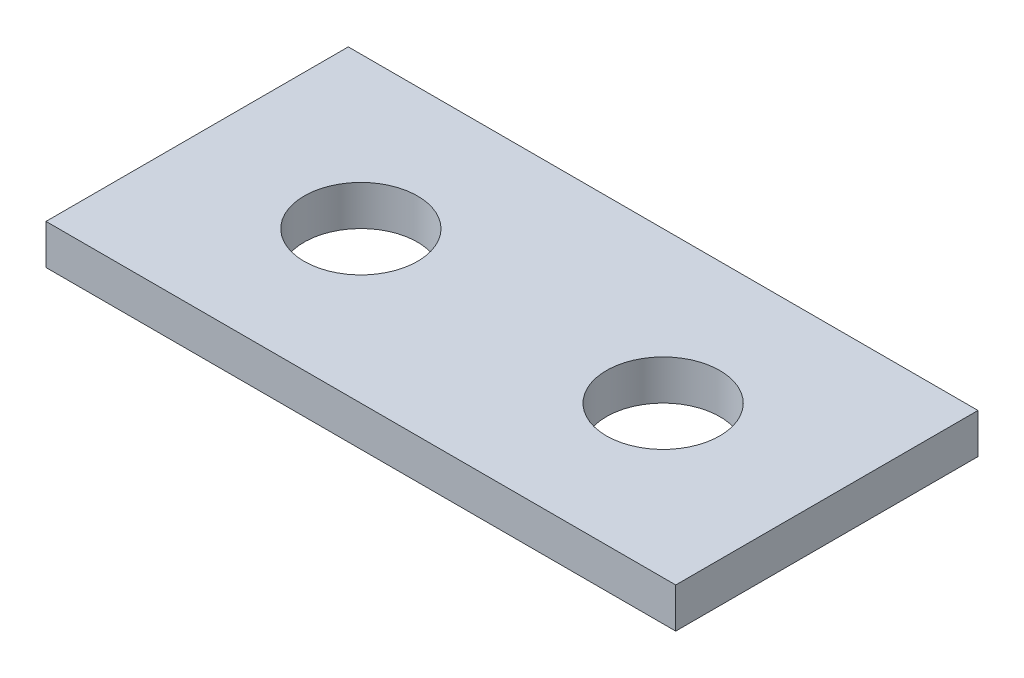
ISO-10303-21;
HEADER;
FILE_DESCRIPTION(('STEP AP214'),'2;1');
FILE_NAME('part.step','',(''),(''),'','','');
FILE_SCHEMA(('AUTOMOTIVE_DESIGN { 1 0 10303 214 1 1 1 1 }'));
ENDSEC;
DATA;
#1=APPLICATION_CONTEXT('core data for automotive mechanical design processes');
#2=APPLICATION_PROTOCOL_DEFINITION('international standard','automotive_design',2000,#1);
#3=PRODUCT_CONTEXT('',#1,'mechanical');
#4=PRODUCT('Part','Part','',(#3));
#5=PRODUCT_RELATED_PRODUCT_CATEGORY('part','',(#4));
#6=PRODUCT_DEFINITION_FORMATION('','',#4);
#7=PRODUCT_DEFINITION_CONTEXT('part definition',#1,'design');
#8=PRODUCT_DEFINITION('design','',#6,#7);
#9=PRODUCT_DEFINITION_SHAPE('','',#8);
#10=(LENGTH_UNIT() NAMED_UNIT(*) SI_UNIT(.MILLI.,.METRE.));
#11=(NAMED_UNIT(*) PLANE_ANGLE_UNIT() SI_UNIT($,.RADIAN.));
#12=(NAMED_UNIT(*) SI_UNIT($,.STERADIAN.) SOLID_ANGLE_UNIT());
#13=UNCERTAINTY_MEASURE_WITH_UNIT(LENGTH_MEASURE(1.E-05),#10,'distance_accuracy_value','');
#14=(GEOMETRIC_REPRESENTATION_CONTEXT(3) GLOBAL_UNCERTAINTY_ASSIGNED_CONTEXT((#13)) GLOBAL_UNIT_ASSIGNED_CONTEXT((#10,
#11,#12)) REPRESENTATION_CONTEXT('',''));
#15=CARTESIAN_POINT('',(0.,0.,0.));
#16=DIRECTION('',(0.,0.,1.));
#17=DIRECTION('',(1.,0.,0.));
#18=AXIS2_PLACEMENT_3D('',#15,#16,#17);
#19=CARTESIAN_POINT('',(25.,3.175,-12.));
#20=DIRECTION('',(-1.,0.,0.));
#21=DIRECTION('',(0.,0.,1.));
#22=AXIS2_PLACEMENT_3D('',#19,#20,#21);
#23=PLANE('',#22);
#24=DIRECTION('',(0.,0.,-1.));
#25=VECTOR('',#24,1.);
#26=CARTESIAN_POINT('',(25.,0.,-12.));
#27=LINE('',#26,#25);
#28=CARTESIAN_POINT('',(25.,0.,12.));
#29=VERTEX_POINT('',#28);
#30=CARTESIAN_POINT('',(25.,0.,-12.));
#31=VERTEX_POINT('',#30);
#32=EDGE_CURVE('E93',#29,#31,#27,.T.);
#33=ORIENTED_EDGE('',*,*,#32,.T.);
#34=DIRECTION('',(0.,-1.,0.));
#35=VECTOR('',#34,1.);
#36=CARTESIAN_POINT('',(25.,3.175,-12.));
#37=LINE('',#36,#35);
#38=CARTESIAN_POINT('',(25.,3.175,-12.));
#39=VERTEX_POINT('',#38);
#40=EDGE_CURVE('E11',#39,#31,#37,.T.);
#41=ORIENTED_EDGE('',*,*,#40,.F.);
#42=DIRECTION('',(0.,0.,-1.));
#43=VECTOR('',#42,1.);
#44=CARTESIAN_POINT('',(25.,3.175,-12.));
#45=LINE('',#44,#43);
#46=CARTESIAN_POINT('',(25.,3.175,12.));
#47=VERTEX_POINT('',#46);
#48=EDGE_CURVE('E81',#47,#39,#45,.T.);
#49=ORIENTED_EDGE('',*,*,#48,.F.);
#50=DIRECTION('',(0.,-1.,0.));
#51=VECTOR('',#50,1.);
#52=CARTESIAN_POINT('',(25.,3.175,12.));
#53=LINE('',#52,#51);
#54=EDGE_CURVE('E89',#47,#29,#53,.T.);
#55=ORIENTED_EDGE('',*,*,#54,.T.);
#56=EDGE_LOOP('',(#33,#41,#49,#55));
#57=FACE_BOUND('',#56,.T.);
#58=ADVANCED_FACE('F30',(#57),#23,.F.);
#59=CARTESIAN_POINT('',(-25.,3.175,-12.));
#60=DIRECTION('',(0.,0.,1.));
#61=DIRECTION('',(1.,0.,0.));
#62=AXIS2_PLACEMENT_3D('',#59,#60,#61);
#63=PLANE('',#62);
#64=DIRECTION('',(-1.,0.,0.));
#65=VECTOR('',#64,1.);
#66=CARTESIAN_POINT('',(-25.,0.,-12.));
#67=LINE('',#66,#65);
#68=CARTESIAN_POINT('',(-25.,0.,-12.));
#69=VERTEX_POINT('',#68);
#70=EDGE_CURVE('E85',#31,#69,#67,.T.);
#71=ORIENTED_EDGE('',*,*,#70,.T.);
#72=DIRECTION('',(0.,-1.,0.));
#73=VECTOR('',#72,1.);
#74=CARTESIAN_POINT('',(-25.,3.175,-12.));
#75=LINE('',#74,#73);
#76=CARTESIAN_POINT('',(-25.,3.175,-12.));
#77=VERTEX_POINT('',#76);
#78=EDGE_CURVE('E38',#77,#69,#75,.T.);
#79=ORIENTED_EDGE('',*,*,#78,.F.);
#80=DIRECTION('',(-1.,0.,0.));
#81=VECTOR('',#80,1.);
#82=CARTESIAN_POINT('',(-25.,3.175,-12.));
#83=LINE('',#82,#81);
#84=EDGE_CURVE('E76',#39,#77,#83,.T.);
#85=ORIENTED_EDGE('',*,*,#84,.F.);
#86=ORIENTED_EDGE('',*,*,#40,.T.);
#87=EDGE_LOOP('',(#71,#79,#85,#86));
#88=FACE_BOUND('',#87,.T.);
#89=ADVANCED_FACE('F84',(#88),#63,.F.);
#90=CARTESIAN_POINT('',(-25.,3.175,-12.));
#91=DIRECTION('',(1.,0.,0.));
#92=DIRECTION('',(0.,0.,-1.));
#93=AXIS2_PLACEMENT_3D('',#90,#91,#92);
#94=PLANE('',#93);
#95=DIRECTION('',(0.,0.,1.));
#96=VECTOR('',#95,1.);
#97=CARTESIAN_POINT('',(-25.,0.,-12.));
#98=LINE('',#97,#96);
#99=CARTESIAN_POINT('',(-25.,0.,12.));
#100=VERTEX_POINT('',#99);
#101=EDGE_CURVE('E63',#69,#100,#98,.T.);
#102=ORIENTED_EDGE('',*,*,#101,.T.);
#103=DIRECTION('',(0.,-1.,0.));
#104=VECTOR('',#103,1.);
#105=CARTESIAN_POINT('',(-25.,3.175,12.));
#106=LINE('',#105,#104);
#107=CARTESIAN_POINT('',(-25.,3.175,12.));
#108=VERTEX_POINT('',#107);
#109=EDGE_CURVE('E86',#108,#100,#106,.T.);
#110=ORIENTED_EDGE('',*,*,#109,.F.);
#111=DIRECTION('',(0.,0.,1.));
#112=VECTOR('',#111,1.);
#113=CARTESIAN_POINT('',(-25.,3.175,-12.));
#114=LINE('',#113,#112);
#115=EDGE_CURVE('E79',#77,#108,#114,.T.);
#116=ORIENTED_EDGE('',*,*,#115,.F.);
#117=ORIENTED_EDGE('',*,*,#78,.T.);
#118=EDGE_LOOP('',(#102,#110,#116,#117));
#119=FACE_BOUND('',#118,.T.);
#120=ADVANCED_FACE('F87',(#119),#94,.F.);
#121=CARTESIAN_POINT('',(-25.,3.175,12.));
#122=DIRECTION('',(0.,0.,-1.));
#123=DIRECTION('',(-1.,0.,0.));
#124=AXIS2_PLACEMENT_3D('',#121,#122,#123);
#125=PLANE('',#124);
#126=DIRECTION('',(1.,0.,0.));
#127=VECTOR('',#126,1.);
#128=CARTESIAN_POINT('',(-25.,0.,12.));
#129=LINE('',#128,#127);
#130=EDGE_CURVE('E69',#100,#29,#129,.T.);
#131=ORIENTED_EDGE('',*,*,#130,.T.);
#132=ORIENTED_EDGE('',*,*,#54,.F.);
#133=DIRECTION('',(1.,0.,0.));
#134=VECTOR('',#133,1.);
#135=CARTESIAN_POINT('',(-25.,3.175,12.));
#136=LINE('',#135,#134);
#137=EDGE_CURVE('E46',#108,#47,#136,.T.);
#138=ORIENTED_EDGE('',*,*,#137,.F.);
#139=ORIENTED_EDGE('',*,*,#109,.T.);
#140=EDGE_LOOP('',(#131,#132,#138,#139));
#141=FACE_BOUND('',#140,.T.);
#142=ADVANCED_FACE('F101',(#141),#125,.F.);
#143=CARTESIAN_POINT('',(25.,3.175,12.));
#144=DIRECTION('',(0.,1.,0.));
#145=DIRECTION('',(0.,0.,1.));
#146=AXIS2_PLACEMENT_3D('',#143,#144,#145);
#147=PLANE('',#146);
#148=CARTESIAN_POINT('',(12.,3.175,0.));
#149=DIRECTION('',(0.,1.,0.));
#150=DIRECTION('',(0.,0.,1.));
#151=AXIS2_PLACEMENT_3D('',#148,#149,#150);
#152=CIRCLE('',#151,4.5);
#153=CARTESIAN_POINT('',(12.,3.175,4.5));
#154=VERTEX_POINT('',#153);
#155=EDGE_CURVE('E115',#154,#154,#152,.T.);
#156=ORIENTED_EDGE('',*,*,#155,.F.);
#157=EDGE_LOOP('',(#156));
#158=FACE_BOUND('',#157,.T.);
#159=CARTESIAN_POINT('',(-12.,3.175,0.));
#160=DIRECTION('',(0.,1.,0.));
#161=DIRECTION('',(0.,0.,1.));
#162=AXIS2_PLACEMENT_3D('',#159,#160,#161);
#163=CIRCLE('',#162,4.5);
#164=CARTESIAN_POINT('',(-12.,3.175,4.5));
#165=VERTEX_POINT('',#164);
#166=EDGE_CURVE('E109',#165,#165,#163,.T.);
#167=ORIENTED_EDGE('',*,*,#166,.F.);
#168=EDGE_LOOP('',(#167));
#169=FACE_BOUND('',#168,.T.);
#170=ORIENTED_EDGE('',*,*,#48,.T.);
#171=ORIENTED_EDGE('',*,*,#84,.T.);
#172=ORIENTED_EDGE('',*,*,#115,.T.);
#173=ORIENTED_EDGE('',*,*,#137,.T.);
#174=EDGE_LOOP('',(#170,#171,#172,#173));
#175=FACE_BOUND('',#174,.T.);
#176=ADVANCED_FACE('F77',(#158,#169,#175),#147,.T.);
#177=CARTESIAN_POINT('',(25.,0.,12.));
#178=DIRECTION('',(0.,1.,0.));
#179=DIRECTION('',(0.,0.,1.));
#180=AXIS2_PLACEMENT_3D('',#177,#178,#179);
#181=PLANE('',#180);
#182=CARTESIAN_POINT('',(12.,0.,0.));
#183=DIRECTION('',(0.,1.,0.));
#184=DIRECTION('',(0.,0.,1.));
#185=AXIS2_PLACEMENT_3D('',#182,#183,#184);
#186=CIRCLE('',#185,4.5);
#187=CARTESIAN_POINT('',(12.,0.,4.5));
#188=VERTEX_POINT('',#187);
#189=EDGE_CURVE('E112',#188,#188,#186,.T.);
#190=ORIENTED_EDGE('',*,*,#189,.T.);
#191=EDGE_LOOP('',(#190));
#192=FACE_BOUND('',#191,.T.);
#193=CARTESIAN_POINT('',(-12.,0.,0.));
#194=DIRECTION('',(0.,1.,0.));
#195=DIRECTION('',(0.,0.,1.));
#196=AXIS2_PLACEMENT_3D('',#193,#194,#195);
#197=CIRCLE('',#196,4.5);
#198=CARTESIAN_POINT('',(-12.,0.,4.5));
#199=VERTEX_POINT('',#198);
#200=EDGE_CURVE('E96',#199,#199,#197,.T.);
#201=ORIENTED_EDGE('',*,*,#200,.T.);
#202=EDGE_LOOP('',(#201));
#203=FACE_BOUND('',#202,.T.);
#204=ORIENTED_EDGE('',*,*,#32,.F.);
#205=ORIENTED_EDGE('',*,*,#130,.F.);
#206=ORIENTED_EDGE('',*,*,#101,.F.);
#207=ORIENTED_EDGE('',*,*,#70,.F.);
#208=EDGE_LOOP('',(#204,#205,#206,#207));
#209=FACE_BOUND('',#208,.T.);
#210=ADVANCED_FACE('F104',(#192,#203,#209),#181,.F.);
#211=CARTESIAN_POINT('',(-12.,3.175,0.));
#212=DIRECTION('',(0.,1.,0.));
#213=DIRECTION('',(0.,0.,1.));
#214=AXIS2_PLACEMENT_3D('',#211,#212,#213);
#215=CYLINDRICAL_SURFACE('',#214,4.5);
#216=ORIENTED_EDGE('',*,*,#200,.F.);
#217=EDGE_LOOP('',(#216));
#218=FACE_BOUND('',#217,.T.);
#219=ORIENTED_EDGE('',*,*,#166,.T.);
#220=EDGE_LOOP('',(#219));
#221=FACE_BOUND('',#220,.T.);
#222=ADVANCED_FACE('F126',(#218,#221),#215,.F.);
#223=CARTESIAN_POINT('',(12.,3.175,0.));
#224=DIRECTION('',(0.,1.,0.));
#225=DIRECTION('',(0.,0.,1.));
#226=AXIS2_PLACEMENT_3D('',#223,#224,#225);
#227=CYLINDRICAL_SURFACE('',#226,4.5);
#228=ORIENTED_EDGE('',*,*,#189,.F.);
#229=EDGE_LOOP('',(#228));
#230=FACE_BOUND('',#229,.T.);
#231=ORIENTED_EDGE('',*,*,#155,.T.);
#232=EDGE_LOOP('',(#231));
#233=FACE_BOUND('',#232,.T.);
#234=ADVANCED_FACE('F119',(#230,#233),#227,.F.);
#235=CLOSED_SHELL('',(#58,#89,#120,#142,#176,#210,#222,#234));
#236=MANIFOLD_SOLID_BREP('B2',#235);
#237=ADVANCED_BREP_SHAPE_REPRESENTATION('',(#18,#236),#14);
#238=SHAPE_DEFINITION_REPRESENTATION(#9,#237);
ENDSEC;
END-ISO-10303-21;
